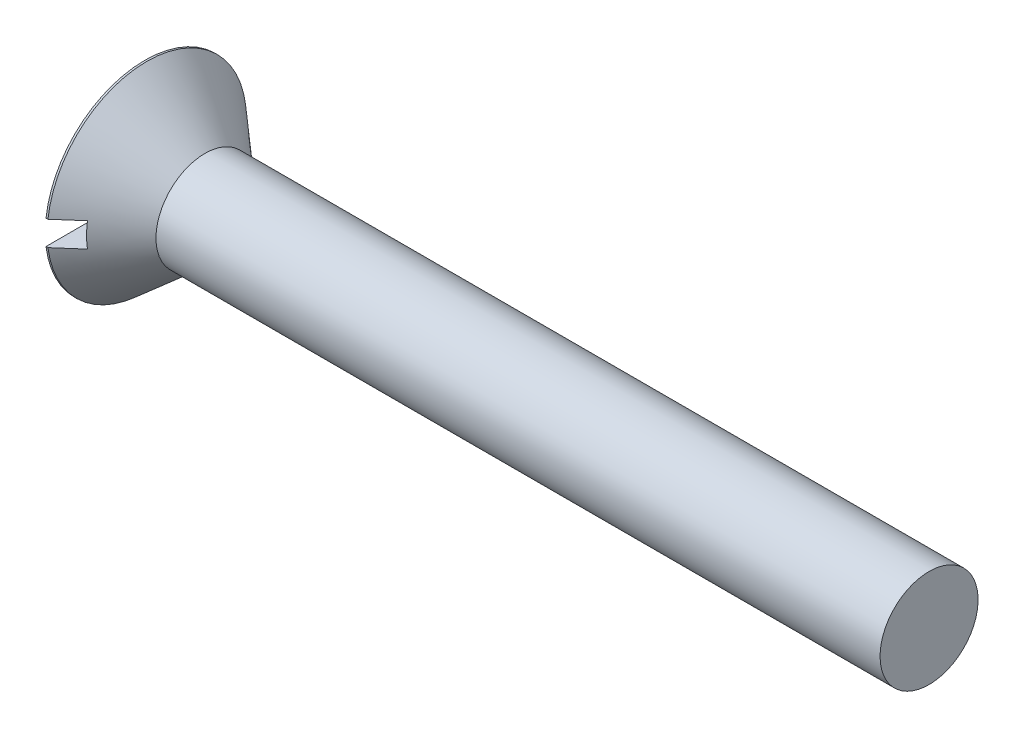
ISO-10303-21;
HEADER;
FILE_DESCRIPTION(('STEP AP214'),'2;1');
FILE_NAME('part.step','',(''),(''),'','','');
FILE_SCHEMA(('AUTOMOTIVE_DESIGN { 1 0 10303 214 1 1 1 1 }'));
ENDSEC;
DATA;
#1=APPLICATION_CONTEXT('core data for automotive mechanical design processes');
#2=APPLICATION_PROTOCOL_DEFINITION('international standard','automotive_design',2000,#1);
#3=PRODUCT_CONTEXT('',#1,'mechanical');
#4=PRODUCT('Part','Part','',(#3));
#5=PRODUCT_RELATED_PRODUCT_CATEGORY('part','',(#4));
#6=PRODUCT_DEFINITION_FORMATION('','',#4);
#7=PRODUCT_DEFINITION_CONTEXT('part definition',#1,'design');
#8=PRODUCT_DEFINITION('design','',#6,#7);
#9=PRODUCT_DEFINITION_SHAPE('','',#8);
#10=(LENGTH_UNIT() NAMED_UNIT(*) SI_UNIT(.MILLI.,.METRE.));
#11=(NAMED_UNIT(*) PLANE_ANGLE_UNIT() SI_UNIT($,.RADIAN.));
#12=(NAMED_UNIT(*) SI_UNIT($,.STERADIAN.) SOLID_ANGLE_UNIT());
#13=UNCERTAINTY_MEASURE_WITH_UNIT(LENGTH_MEASURE(1.E-05),#10,'distance_accuracy_value','');
#14=(GEOMETRIC_REPRESENTATION_CONTEXT(3) GLOBAL_UNCERTAINTY_ASSIGNED_CONTEXT((#13)) GLOBAL_UNIT_ASSIGNED_CONTEXT((#10,
#11,#12)) REPRESENTATION_CONTEXT('',''));
#15=CARTESIAN_POINT('',(0.,0.,0.));
#16=DIRECTION('',(0.,0.,1.));
#17=DIRECTION('',(1.,0.,0.));
#18=AXIS2_PLACEMENT_3D('',#15,#16,#17);
#19=CARTESIAN_POINT('',(0.,0.,0.));
#20=DIRECTION('',(-1.,0.,0.));
#21=DIRECTION('',(0.,0.,1.));
#22=AXIS2_PLACEMENT_3D('',#19,#20,#21);
#23=PLANE('',#22);
#24=DIRECTION('',(0.,0.,-1.));
#25=VECTOR('',#24,1.);
#26=CARTESIAN_POINT('',(0.,1.1938,9.6774));
#27=LINE('',#26,#25);
#28=CARTESIAN_POINT('',(0.,1.1938,9.60348438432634));
#29=VERTEX_POINT('',#28);
#30=CARTESIAN_POINT('',(0.,1.1938,-9.60348438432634));
#31=VERTEX_POINT('',#30);
#32=EDGE_CURVE('E152',#29,#31,#27,.T.);
#33=ORIENTED_EDGE('',*,*,#32,.F.);
#34=CARTESIAN_POINT('',(0.,0.,0.));
#35=DIRECTION('',(-1.,0.,0.));
#36=DIRECTION('',(0.,0.,1.));
#37=AXIS2_PLACEMENT_3D('',#34,#35,#36);
#38=CIRCLE('',#37,9.6774);
#39=EDGE_CURVE('E106',#29,#31,#38,.T.);
#40=ORIENTED_EDGE('',*,*,#39,.T.);
#41=EDGE_LOOP('',(#33,#40));
#42=FACE_BOUND('',#41,.T.);
#43=ADVANCED_FACE('F39',(#42),#23,.T.);
#44=CARTESIAN_POINT('',(-6.34999999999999,0.,0.));
#45=DIRECTION('',(-1.,0.,0.));
#46=DIRECTION('',(0.,0.,1.));
#47=AXIS2_PLACEMENT_3D('',#44,#45,#46);
#48=CYLINDRICAL_SURFACE('',#47,9.6774);
#49=DIRECTION('',(-1.,0.,0.));
#50=VECTOR('',#49,1.);
#51=CARTESIAN_POINT('',(-6.34999999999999,1.1938,-9.60348438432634));
#52=LINE('',#51,#50);
#53=CARTESIAN_POINT('',(0.188054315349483,1.1938,-9.60348438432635));
#54=VERTEX_POINT('',#53);
#55=EDGE_CURVE('E68',#31,#54,#52,.F.);
#56=ORIENTED_EDGE('',*,*,#55,.F.);
#57=ORIENTED_EDGE('',*,*,#39,.F.);
#58=DIRECTION('',(-1.,0.,0.));
#59=VECTOR('',#58,1.);
#60=CARTESIAN_POINT('',(-6.34999999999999,1.1938,9.60348438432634));
#61=LINE('',#60,#59);
#62=CARTESIAN_POINT('',(0.188054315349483,1.1938,9.60348438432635));
#63=VERTEX_POINT('',#62);
#64=EDGE_CURVE('E155',#63,#29,#61,.T.);
#65=ORIENTED_EDGE('',*,*,#64,.F.);
#66=CARTESIAN_POINT('',(0.188054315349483,0.,0.));
#67=DIRECTION('',(-1.,0.,0.));
#68=DIRECTION('',(0.,0.,1.));
#69=AXIS2_PLACEMENT_3D('',#66,#67,#68);
#70=CIRCLE('',#69,9.6774);
#71=EDGE_CURVE('E117',#63,#54,#70,.T.);
#72=ORIENTED_EDGE('',*,*,#71,.T.);
#73=EDGE_LOOP('',(#56,#57,#65,#72));
#74=FACE_BOUND('',#73,.T.);
#75=ADVANCED_FACE('F154',(#74),#48,.T.);
#76=DIRECTION('',(0.,0.,1.));
#77=VECTOR('',#76,1.);
#78=CARTESIAN_POINT('',(0.,-1.1938,-9.6774));
#79=LINE('',#78,#77);
#80=CARTESIAN_POINT('',(0.,-1.1938,-9.60348438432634));
#81=VERTEX_POINT('',#80);
#82=CARTESIAN_POINT('',(0.,-1.1938,9.60348438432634));
#83=VERTEX_POINT('',#82);
#84=EDGE_CURVE('E111',#81,#83,#79,.T.);
#85=ORIENTED_EDGE('',*,*,#84,.F.);
#86=EDGE_CURVE('E137',#81,#83,#38,.T.);
#87=ORIENTED_EDGE('',*,*,#86,.T.);
#88=EDGE_LOOP('',(#85,#87));
#89=FACE_BOUND('',#88,.T.);
#90=ADVANCED_FACE('F41',(#89),#23,.T.);
#91=DIRECTION('',(-1.,0.,0.));
#92=VECTOR('',#91,1.);
#93=CARTESIAN_POINT('',(-6.34999999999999,-1.1938,9.60348438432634));
#94=LINE('',#93,#92);
#95=CARTESIAN_POINT('',(0.188054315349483,-1.1938,9.60348438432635));
#96=VERTEX_POINT('',#95);
#97=EDGE_CURVE('E138',#83,#96,#94,.F.);
#98=ORIENTED_EDGE('',*,*,#97,.F.);
#99=ORIENTED_EDGE('',*,*,#86,.F.);
#100=DIRECTION('',(-1.,0.,0.));
#101=VECTOR('',#100,1.);
#102=CARTESIAN_POINT('',(-6.34999999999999,-1.1938,-9.60348438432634));
#103=LINE('',#102,#101);
#104=CARTESIAN_POINT('',(0.188054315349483,-1.1938,-9.60348438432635));
#105=VERTEX_POINT('',#104);
#106=EDGE_CURVE('E127',#105,#81,#103,.T.);
#107=ORIENTED_EDGE('',*,*,#106,.F.);
#108=EDGE_CURVE('E135',#105,#96,#70,.T.);
#109=ORIENTED_EDGE('',*,*,#108,.T.);
#110=EDGE_LOOP('',(#98,#99,#107,#109));
#111=FACE_BOUND('',#110,.T.);
#112=ADVANCED_FACE('F134',(#111),#48,.T.);
#113=CARTESIAN_POINT('',(0.188054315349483,0.,0.));
#114=DIRECTION('',(-1.,0.,0.));
#115=DIRECTION('',(0.,0.,1.));
#116=AXIS2_PLACEMENT_3D('',#113,#114,#115);
#117=CONICAL_SURFACE('',#116,9.6774,0.715584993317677);
#118=CARTESIAN_POINT('',(-11.4898026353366,1.1938,-19.7928369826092));
#119=CARTESIAN_POINT('',(-10.7282739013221,1.1938,-19.1296381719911));
#120=CARTESIAN_POINT('',(-9.96679664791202,1.1938,-18.4663802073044));
#121=CARTESIAN_POINT('',(-8.44400448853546,1.1938,-17.1396696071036));
#122=CARTESIAN_POINT('',(-7.68268958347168,1.1938,-16.4762169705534));
#123=CARTESIAN_POINT('',(-6.16009107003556,1.1938,-15.1488746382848));
#124=CARTESIAN_POINT('',(-5.39880752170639,1.1938,-14.4849848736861));
#125=CARTESIAN_POINT('',(-3.87658787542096,1.1938,-13.156815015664));
#126=CARTESIAN_POINT('',(-3.11565177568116,1.1938,-12.4925349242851));
#127=CARTESIAN_POINT('',(-1.61266837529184,1.1938,-11.1793728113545));
#128=CARTESIAN_POINT('',(-0.870608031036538,1.1938,-10.5305057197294));
#129=CARTESIAN_POINT('',(0.612654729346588,1.1938,-9.23176820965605));
#130=CARTESIAN_POINT('',(1.35385713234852,1.1938,-8.58189777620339));
#131=CARTESIAN_POINT('',(2.46431349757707,1.1938,-7.6057063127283));
#132=CARTESIAN_POINT('',(2.83420463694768,1.1938,-7.28011039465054));
#133=CARTESIAN_POINT('',(3.5733462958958,1.1938,-6.62818839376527));
#134=CARTESIAN_POINT('',(3.94259681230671,1.1938,-6.30186230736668));
#135=CARTESIAN_POINT('',(4.68009898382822,1.1938,-5.64810195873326));
#136=CARTESIAN_POINT('',(5.04835066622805,1.1938,-5.32066772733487));
#137=CARTESIAN_POINT('',(5.59944958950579,1.1938,-4.828088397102));
#138=CARTESIAN_POINT('',(5.78293538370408,1.1938,-4.66365796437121));
#139=CARTESIAN_POINT('',(6.14932062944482,1.1938,-4.33414540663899));
#140=CARTESIAN_POINT('',(6.33222008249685,1.1938,-4.16906328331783));
#141=CARTESIAN_POINT('',(6.61085838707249,1.1938,-3.91630624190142));
#142=CARTESIAN_POINT('',(6.7068950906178,1.1938,-3.82895981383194));
#143=CARTESIAN_POINT('',(6.89868546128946,1.1938,-3.65395652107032));
#144=CARTESIAN_POINT('',(6.99443912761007,1.1938,-3.56629965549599));
#145=CARTESIAN_POINT('',(7.28123634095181,1.1938,-3.30272759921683));
#146=CARTESIAN_POINT('',(7.47176893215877,1.1938,-3.12625362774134));
#147=CARTESIAN_POINT('',(7.75652836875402,1.1938,-2.85918720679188));
#148=CARTESIAN_POINT('',(7.85158225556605,1.1938,-2.76947695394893));
#149=CARTESIAN_POINT('',(8.04094270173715,1.1938,-2.58927165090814));
#150=CARTESIAN_POINT('',(8.13524926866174,1.1938,-2.49877660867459));
#151=CARTESIAN_POINT('',(8.32280199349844,1.1938,-2.31680042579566));
#152=CARTESIAN_POINT('',(8.41604873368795,1.1938,-2.22531988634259));
#153=CARTESIAN_POINT('',(8.6011346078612,1.1938,-2.04094854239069));
#154=CARTESIAN_POINT('',(8.6929738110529,1.1938,-1.94805780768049));
#155=CARTESIAN_POINT('',(8.87422797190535,1.1938,-1.76066399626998));
#156=CARTESIAN_POINT('',(8.96365125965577,1.1938,-1.66616899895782));
#157=CARTESIAN_POINT('',(9.13952454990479,1.1938,-1.47414431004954));
#158=CARTESIAN_POINT('',(9.22596985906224,1.1938,-1.37661025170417));
#159=CARTESIAN_POINT('',(9.35151816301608,1.1938,-1.22717825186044));
#160=CARTESIAN_POINT('',(9.39260236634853,1.1938,-1.17695004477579));
#161=CARTESIAN_POINT('',(9.47299969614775,1.1938,-1.07510106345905));
#162=CARTESIAN_POINT('',(9.5123131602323,1.1938,-1.02348055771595));
#163=CARTESIAN_POINT('',(9.58844644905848,1.1938,-0.918595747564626));
#164=CARTESIAN_POINT('',(9.62527166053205,1.1938,-0.865335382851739));
#165=CARTESIAN_POINT('',(9.69553557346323,1.1938,-0.756643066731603));
#166=CARTESIAN_POINT('',(9.72897683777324,1.1938,-0.701212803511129));
#167=CARTESIAN_POINT('',(9.78229490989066,1.1938,-0.603634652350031));
#168=CARTESIAN_POINT('',(9.80334267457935,1.1938,-0.562131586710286));
#169=CARTESIAN_POINT('',(9.84217202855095,1.1938,-0.47758953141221));
#170=CARTESIAN_POINT('',(9.85995294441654,1.1938,-0.434550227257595));
#171=CARTESIAN_POINT('',(9.89116809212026,1.1938,-0.347314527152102));
#172=CARTESIAN_POINT('',(9.90463847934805,1.1938,-0.303131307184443));
#173=CARTESIAN_POINT('',(9.92643385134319,1.1938,-0.213513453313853));
#174=CARTESIAN_POINT('',(9.93476333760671,1.1938,-0.16807995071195));
#175=CARTESIAN_POINT('',(9.94391422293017,1.1938,-0.0900477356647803));
#176=CARTESIAN_POINT('',(9.94622642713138,1.1938,-0.057620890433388));
#177=CARTESIAN_POINT('',(9.94780330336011,1.1938,0.00730866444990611));
#178=CARTESIAN_POINT('',(9.94706765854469,1.1938,0.039811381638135));
#179=CARTESIAN_POINT('',(9.94028733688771,1.1938,0.137101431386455));
#180=CARTESIAN_POINT('',(9.92966101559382,1.1938,0.20160008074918));
#181=CARTESIAN_POINT('',(9.89262661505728,1.1938,0.35049459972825));
#182=CARTESIAN_POINT('',(9.86193906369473,1.1938,0.433774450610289));
#183=CARTESIAN_POINT('',(9.80699388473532,1.1938,0.554532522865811));
#184=CARTESIAN_POINT('',(9.78712669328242,1.1938,0.594194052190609));
#185=CARTESIAN_POINT('',(9.74504611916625,1.1938,0.672252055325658));
#186=CARTESIAN_POINT('',(9.72283341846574,1.1938,0.710648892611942));
#187=CARTESIAN_POINT('',(9.65802013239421,1.1938,0.816731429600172));
#188=CARTESIAN_POINT('',(9.61337970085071,1.1938,0.883159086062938));
#189=CARTESIAN_POINT('',(9.52026331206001,1.1938,1.01329132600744));
#190=CARTESIAN_POINT('',(9.47178430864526,1.1938,1.07699368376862));
#191=CARTESIAN_POINT('',(9.37210823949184,1.1938,1.20247328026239));
#192=CARTESIAN_POINT('',(9.32090484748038,1.1938,1.2642454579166));
#193=CARTESIAN_POINT('',(9.21665334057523,1.1938,1.38621561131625));
#194=CARTESIAN_POINT('',(9.16360498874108,1.1938,1.44641338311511));
#195=CARTESIAN_POINT('',(9.0558712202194,1.1938,1.56591847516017));
#196=CARTESIAN_POINT('',(9.00117844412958,1.1938,1.62521913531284));
#197=CARTESIAN_POINT('',(8.89076932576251,1.1938,1.74286468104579));
#198=CARTESIAN_POINT('',(8.83505291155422,1.1938,1.80120949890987));
#199=CARTESIAN_POINT('',(8.72293087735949,1.1938,1.91703874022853));
#200=CARTESIAN_POINT('',(8.66652659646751,1.1938,1.97452446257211));
#201=CARTESIAN_POINT('',(8.55310321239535,1.1938,2.08888148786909));
#202=CARTESIAN_POINT('',(8.49608412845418,1.1938,2.14575280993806));
#203=CARTESIAN_POINT('',(8.32594080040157,1.1938,2.31399298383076));
#204=CARTESIAN_POINT('',(8.21210974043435,1.1938,2.4246466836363));
#205=CARTESIAN_POINT('',(7.98316902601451,1.1938,2.64462506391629));
#206=CARTESIAN_POINT('',(7.86805933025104,1.1938,2.75394970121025));
#207=CARTESIAN_POINT('',(7.63692082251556,1.1938,2.97164536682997));
#208=CARTESIAN_POINT('',(7.52089191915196,1.1938,3.08001629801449));
#209=CARTESIAN_POINT('',(7.2881654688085,1.1938,3.29603831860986));
#210=CARTESIAN_POINT('',(7.17146791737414,1.1938,3.40368940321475));
#211=CARTESIAN_POINT('',(6.8204206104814,1.1938,3.72601676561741));
#212=CARTESIAN_POINT('',(6.58532082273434,1.1938,3.93987573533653));
#213=CARTESIAN_POINT('',(6.11392315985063,1.1938,4.36623728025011));
#214=CARTESIAN_POINT('',(5.87762535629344,1.1938,4.57873993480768));
#215=CARTESIAN_POINT('',(5.40574548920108,1.1938,5.00148246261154));
#216=CARTESIAN_POINT('',(5.17016858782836,1.1938,5.21172810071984));
#217=CARTESIAN_POINT('',(4.69845742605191,1.1938,5.63159996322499));
#218=CARTESIAN_POINT('',(4.46232315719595,1.1938,5.8412261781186));
#219=CARTESIAN_POINT('',(3.75350149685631,1.1938,6.46928311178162));
#220=CARTESIAN_POINT('',(3.28022270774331,1.1938,6.88704616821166));
#221=CARTESIAN_POINT('',(2.21621828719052,1.1938,7.82423394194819));
#222=CARTESIAN_POINT('',(1.62524790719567,1.1938,8.34338046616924));
#223=CARTESIAN_POINT('',(0.442525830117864,1.1938,9.38078521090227));
#224=CARTESIAN_POINT('',(-0.149225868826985,1.1938,9.89904342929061));
#225=CARTESIAN_POINT('',(-1.33330631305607,1.1938,10.9350846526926));
#226=CARTESIAN_POINT('',(-1.92563513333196,1.1938,11.4528675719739));
#227=CARTESIAN_POINT('',(-3.11061605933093,1.1938,12.4880633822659));
#228=CARTESIAN_POINT('',(-3.70326816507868,1.1938,13.0054762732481));
#229=CARTESIAN_POINT('',(-5.49445193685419,1.1938,14.5685909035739));
#230=CARTESIAN_POINT('',(-6.69332378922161,1.1938,15.6139027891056));
#231=CARTESIAN_POINT('',(-8.49189186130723,1.1938,17.1813761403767));
#232=CARTESIAN_POINT('',(-9.09140946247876,1.1938,17.7037426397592));
#233=CARTESIAN_POINT('',(-10.2905401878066,1.1938,18.7483656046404));
#234=CARTESIAN_POINT('',(-10.8901533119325,1.1938,19.2706220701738));
#235=CARTESIAN_POINT('',(-11.4898026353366,1.1938,19.7928369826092));
#236=B_SPLINE_CURVE_WITH_KNOTS('',3,(#118,#119,#120,#121,#122,#123,#124,#125,#126,#127,#128,
#129,#130,#131,#132,#133,#134,#135,#136,#137,#138,#139,#140,#141,#142,#143,#144,#145,#146,#147,
#148,#149,#150,#151,#152,#153,#154,#155,#156,#157,#158,#159,#160,#161,#162,#163,#164,#165,#166,
#167,#168,#169,#170,#171,#172,#173,#174,#175,#176,#177,#178,#179,#180,#181,#182,#183,#184,#185,
#186,#187,#188,#189,#190,#191,#192,#193,#194,#195,#196,#197,#198,#199,#200,#201,#202,#203,#204,
#205,#206,#207,#208,#209,#210,#211,#212,#213,#214,#215,#216,#217,#218,#219,#220,#221,#222,#223,
#224,#225,#226,#227,#228,#229,#230,#231,#232,#233,#234,#235),.UNSPECIFIED.,.F.,.F.,(4,2,2,2,2,2,
2,2,2,2,2,2,2,2,2,2,2,2,2,2,2,2,2,2,2,2,2,2,2,2,2,2,2,2,2,2,2,2,2,2,2,2,2,2,2,2,2,2,2,2,2,2,2,2,
2,2,2,2,4),(0.,3.0294930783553,6.05900258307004,9.08930288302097,12.1195874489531,
15.0768051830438,18.0340675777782,19.512406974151,20.9907536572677,22.4690595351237,
23.2082064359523,23.9473514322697,24.3368016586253,24.7262529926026,25.5053464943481,
25.8974512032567,26.2895519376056,26.6814256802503,27.0732800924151,27.4635432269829,
27.8543956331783,28.0490394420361,28.2436459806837,28.4378167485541,28.6318393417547,
28.7713378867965,28.9108651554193,29.049189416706,29.1873923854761,29.2847831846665,
29.3821841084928,29.5771956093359,29.8418190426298,29.9748586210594,30.1078596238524,
30.3477358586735,30.5878043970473,30.8284570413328,31.0691407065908,31.3111390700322,
31.5531545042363,31.7947567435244,32.0363514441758,32.5125848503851,32.9888336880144,
33.4651304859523,33.9414304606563,34.894870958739,35.8482551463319,36.7955112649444,
37.7427818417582,39.6366290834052,41.9964650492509,44.3563066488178,46.7165126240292,
49.0767187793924,53.8484828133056,56.2339792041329,58.619474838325),.UNSPECIFIED.);
#237=CARTESIAN_POINT('',(2.2352,1.1938,-7.80709754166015));
#238=VERTEX_POINT('',#237);
#239=EDGE_CURVE('E11',#54,#238,#236,.T.);
#240=ORIENTED_EDGE('',*,*,#239,.F.);
#241=ORIENTED_EDGE('',*,*,#71,.F.);
#242=CARTESIAN_POINT('',(2.2352,1.1938,7.80709754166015));
#243=VERTEX_POINT('',#242);
#244=EDGE_CURVE('E43',#243,#63,#236,.T.);
#245=ORIENTED_EDGE('',*,*,#244,.F.);
#246=CARTESIAN_POINT('',(2.2352,0.,0.));
#247=DIRECTION('',(-1.,0.,0.));
#248=DIRECTION('',(0.,0.,1.));
#249=AXIS2_PLACEMENT_3D('',#246,#247,#248);
#250=CIRCLE('',#249,7.89784340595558);
#251=CARTESIAN_POINT('',(2.2352,-1.1938,7.80709754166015));
#252=VERTEX_POINT('',#251);
#253=EDGE_CURVE('E97',#243,#252,#250,.F.);
#254=ORIENTED_EDGE('',*,*,#253,.T.);
#255=CARTESIAN_POINT('',(-11.4898026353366,-1.1938,19.7928369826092));
#256=CARTESIAN_POINT('',(-10.7282739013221,-1.1938,19.1296381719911));
#257=CARTESIAN_POINT('',(-9.96679664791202,-1.1938,18.4663802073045));
#258=CARTESIAN_POINT('',(-8.44400448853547,-1.1938,17.1396696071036));
#259=CARTESIAN_POINT('',(-7.68268958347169,-1.1938,16.4762169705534));
#260=CARTESIAN_POINT('',(-6.16009107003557,-1.1938,15.1488746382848));
#261=CARTESIAN_POINT('',(-5.39880752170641,-1.1938,14.4849848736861));
#262=CARTESIAN_POINT('',(-3.87658787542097,-1.1938,13.156815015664));
#263=CARTESIAN_POINT('',(-3.11565177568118,-1.1938,12.4925349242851));
#264=CARTESIAN_POINT('',(-1.61266837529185,-1.1938,11.1793728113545));
#265=CARTESIAN_POINT('',(-0.870608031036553,-1.1938,10.5305057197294));
#266=CARTESIAN_POINT('',(0.612654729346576,-1.1938,9.23176820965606));
#267=CARTESIAN_POINT('',(1.35385713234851,-1.1938,8.5818977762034));
#268=CARTESIAN_POINT('',(2.46431349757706,-1.1938,7.60570631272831));
#269=CARTESIAN_POINT('',(2.83420463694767,-1.1938,7.28011039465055));
#270=CARTESIAN_POINT('',(3.5733462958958,-1.1938,6.62818839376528));
#271=CARTESIAN_POINT('',(3.9425968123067,-1.1938,6.30186230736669));
#272=CARTESIAN_POINT('',(4.68009898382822,-1.1938,5.64810195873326));
#273=CARTESIAN_POINT('',(5.04835066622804,-1.1938,5.32066772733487));
#274=CARTESIAN_POINT('',(5.59944958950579,-1.1938,4.828088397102));
#275=CARTESIAN_POINT('',(5.78293538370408,-1.1938,4.66365796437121));
#276=CARTESIAN_POINT('',(6.14932062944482,-1.1938,4.33414540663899));
#277=CARTESIAN_POINT('',(6.33222008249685,-1.1938,4.16906328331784));
#278=CARTESIAN_POINT('',(6.61085838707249,-1.1938,3.91630624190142));
#279=CARTESIAN_POINT('',(6.7068950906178,-1.1938,3.82895981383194));
#280=CARTESIAN_POINT('',(6.89868546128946,-1.1938,3.65395652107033));
#281=CARTESIAN_POINT('',(6.99443912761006,-1.1938,3.56629965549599));
#282=CARTESIAN_POINT('',(7.28123634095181,-1.1938,3.30272759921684));
#283=CARTESIAN_POINT('',(7.47176893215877,-1.1938,3.12625362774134));
#284=CARTESIAN_POINT('',(7.75652836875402,-1.1938,2.85918720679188));
#285=CARTESIAN_POINT('',(7.85158225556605,-1.1938,2.76947695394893));
#286=CARTESIAN_POINT('',(8.04094270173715,-1.1938,2.58927165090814));
#287=CARTESIAN_POINT('',(8.13524926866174,-1.1938,2.49877660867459));
#288=CARTESIAN_POINT('',(8.32280199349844,-1.1938,2.31680042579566));
#289=CARTESIAN_POINT('',(8.41604873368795,-1.1938,2.22531988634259));
#290=CARTESIAN_POINT('',(8.6011346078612,-1.1938,2.04094854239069));
#291=CARTESIAN_POINT('',(8.6929738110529,-1.1938,1.94805780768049));
#292=CARTESIAN_POINT('',(8.87422797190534,-1.1938,1.76066399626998));
#293=CARTESIAN_POINT('',(8.96365125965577,-1.1938,1.66616899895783));
#294=CARTESIAN_POINT('',(9.13952454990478,-1.1938,1.47414431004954));
#295=CARTESIAN_POINT('',(9.22596985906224,-1.1938,1.37661025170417));
#296=CARTESIAN_POINT('',(9.35151816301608,-1.1938,1.22717825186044));
#297=CARTESIAN_POINT('',(9.39260236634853,-1.1938,1.17695004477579));
#298=CARTESIAN_POINT('',(9.47299969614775,-1.1938,1.07510106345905));
#299=CARTESIAN_POINT('',(9.5123131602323,-1.1938,1.02348055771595));
#300=CARTESIAN_POINT('',(9.58844644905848,-1.1938,0.918595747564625));
#301=CARTESIAN_POINT('',(9.62527166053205,-1.1938,0.865335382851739));
#302=CARTESIAN_POINT('',(9.69553557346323,-1.1938,0.756643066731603));
#303=CARTESIAN_POINT('',(9.72897683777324,-1.1938,0.701212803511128));
#304=CARTESIAN_POINT('',(9.78229490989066,-1.1938,0.603634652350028));
#305=CARTESIAN_POINT('',(9.80334267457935,-1.1938,0.562131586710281));
#306=CARTESIAN_POINT('',(9.84217202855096,-1.1938,0.477589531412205));
#307=CARTESIAN_POINT('',(9.85995294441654,-1.1938,0.434550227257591));
#308=CARTESIAN_POINT('',(9.89116809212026,-1.1938,0.347314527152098));
#309=CARTESIAN_POINT('',(9.90463847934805,-1.1938,0.303131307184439));
#310=CARTESIAN_POINT('',(9.92643385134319,-1.1938,0.21351345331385));
#311=CARTESIAN_POINT('',(9.93476333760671,-1.1938,0.168079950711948));
#312=CARTESIAN_POINT('',(9.94391422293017,-1.1938,0.0900477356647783));
#313=CARTESIAN_POINT('',(9.94622642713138,-1.1938,0.0576208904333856));
#314=CARTESIAN_POINT('',(9.94780330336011,-1.1938,-0.0073086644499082));
#315=CARTESIAN_POINT('',(9.94706765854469,-1.1938,-0.0398113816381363));
#316=CARTESIAN_POINT('',(9.94028733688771,-1.1938,-0.137101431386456));
#317=CARTESIAN_POINT('',(9.92966101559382,-1.1938,-0.201600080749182));
#318=CARTESIAN_POINT('',(9.89262661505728,-1.1938,-0.350494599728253));
#319=CARTESIAN_POINT('',(9.86193906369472,-1.1938,-0.433774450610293));
#320=CARTESIAN_POINT('',(9.80699388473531,-1.1938,-0.554532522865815));
#321=CARTESIAN_POINT('',(9.78712669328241,-1.1938,-0.594194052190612));
#322=CARTESIAN_POINT('',(9.74504611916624,-1.1938,-0.672252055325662));
#323=CARTESIAN_POINT('',(9.72283341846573,-1.1938,-0.710648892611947));
#324=CARTESIAN_POINT('',(9.65802013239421,-1.1938,-0.816731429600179));
#325=CARTESIAN_POINT('',(9.61337970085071,-1.1938,-0.883159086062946));
#326=CARTESIAN_POINT('',(9.52026331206,-1.1938,-1.01329132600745));
#327=CARTESIAN_POINT('',(9.47178430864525,-1.1938,-1.07699368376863));
#328=CARTESIAN_POINT('',(9.37210823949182,-1.1938,-1.2024732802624));
#329=CARTESIAN_POINT('',(9.32090484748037,-1.1938,-1.26424545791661));
#330=CARTESIAN_POINT('',(9.21665334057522,-1.1938,-1.38621561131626));
#331=CARTESIAN_POINT('',(9.16360498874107,-1.1938,-1.44641338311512));
#332=CARTESIAN_POINT('',(9.05587122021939,-1.1938,-1.56591847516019));
#333=CARTESIAN_POINT('',(9.00117844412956,-1.1938,-1.62521913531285));
#334=CARTESIAN_POINT('',(8.8907693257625,-1.1938,-1.7428646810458));
#335=CARTESIAN_POINT('',(8.83505291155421,-1.1938,-1.80120949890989));
#336=CARTESIAN_POINT('',(8.72293087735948,-1.1938,-1.91703874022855));
#337=CARTESIAN_POINT('',(8.6665265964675,-1.1938,-1.97452446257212));
#338=CARTESIAN_POINT('',(8.55310321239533,-1.1938,-2.08888148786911));
#339=CARTESIAN_POINT('',(8.49608412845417,-1.1938,-2.14575280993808));
#340=CARTESIAN_POINT('',(8.32594080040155,-1.1938,-2.31399298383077));
#341=CARTESIAN_POINT('',(8.21210974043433,-1.1938,-2.42464668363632));
#342=CARTESIAN_POINT('',(7.98316902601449,-1.1938,-2.64462506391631));
#343=CARTESIAN_POINT('',(7.86805933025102,-1.1938,-2.75394970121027));
#344=CARTESIAN_POINT('',(7.63692082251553,-1.1938,-2.97164536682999));
#345=CARTESIAN_POINT('',(7.52089191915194,-1.1938,-3.08001629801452));
#346=CARTESIAN_POINT('',(7.28816546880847,-1.1938,-3.29603831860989));
#347=CARTESIAN_POINT('',(7.17146791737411,-1.1938,-3.40368940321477));
#348=CARTESIAN_POINT('',(6.82042061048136,-1.1938,-3.72601676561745));
#349=CARTESIAN_POINT('',(6.5853208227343,-1.1938,-3.93987573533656));
#350=CARTESIAN_POINT('',(6.11392315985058,-1.1938,-4.36623728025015));
#351=CARTESIAN_POINT('',(5.87762535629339,-1.1938,-4.57873993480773));
#352=CARTESIAN_POINT('',(5.40574548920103,-1.1938,-5.00148246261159));
#353=CARTESIAN_POINT('',(5.17016858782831,-1.1938,-5.21172810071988));
#354=CARTESIAN_POINT('',(4.69845742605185,-1.1938,-5.63159996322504));
#355=CARTESIAN_POINT('',(4.46232315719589,-1.1938,-5.84122617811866));
#356=CARTESIAN_POINT('',(3.75350149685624,-1.1938,-6.46928311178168));
#357=CARTESIAN_POINT('',(3.28022270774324,-1.1938,-6.88704616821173));
#358=CARTESIAN_POINT('',(2.21621828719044,-1.1938,-7.82423394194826));
#359=CARTESIAN_POINT('',(1.62524790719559,-1.1938,-8.34338046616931));
#360=CARTESIAN_POINT('',(0.442525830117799,-1.1938,-9.38078521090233));
#361=CARTESIAN_POINT('',(-0.149225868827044,-1.1938,-9.89904342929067));
#362=CARTESIAN_POINT('',(-1.33330631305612,-1.1938,-10.9350846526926));
#363=CARTESIAN_POINT('',(-1.92563513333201,-1.1938,-11.452867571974));
#364=CARTESIAN_POINT('',(-3.11061605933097,-1.1938,-12.4880633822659));
#365=CARTESIAN_POINT('',(-3.70326816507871,-1.1938,-13.0054762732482));
#366=CARTESIAN_POINT('',(-5.49445193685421,-1.1938,-14.5685909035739));
#367=CARTESIAN_POINT('',(-6.69332378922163,-1.1938,-15.6139027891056));
#368=CARTESIAN_POINT('',(-8.49189186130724,-1.1938,-17.1813761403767));
#369=CARTESIAN_POINT('',(-9.09140946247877,-1.1938,-17.7037426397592));
#370=CARTESIAN_POINT('',(-10.2905401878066,-1.1938,-18.7483656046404));
#371=CARTESIAN_POINT('',(-10.8901533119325,-1.1938,-19.2706220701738));
#372=CARTESIAN_POINT('',(-11.4898026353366,-1.1938,-19.7928369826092));
#373=B_SPLINE_CURVE_WITH_KNOTS('',3,(#255,#256,#257,#258,#259,#260,#261,#262,#263,#264,#265,
#266,#267,#268,#269,#270,#271,#272,#273,#274,#275,#276,#277,#278,#279,#280,#281,#282,#283,#284,
#285,#286,#287,#288,#289,#290,#291,#292,#293,#294,#295,#296,#297,#298,#299,#300,#301,#302,#303,
#304,#305,#306,#307,#308,#309,#310,#311,#312,#313,#314,#315,#316,#317,#318,#319,#320,#321,#322,
#323,#324,#325,#326,#327,#328,#329,#330,#331,#332,#333,#334,#335,#336,#337,#338,#339,#340,#341,
#342,#343,#344,#345,#346,#347,#348,#349,#350,#351,#352,#353,#354,#355,#356,#357,#358,#359,#360,
#361,#362,#363,#364,#365,#366,#367,#368,#369,#370,#371,#372),.UNSPECIFIED.,.F.,.F.,(4,2,2,2,2,2,
2,2,2,2,2,2,2,2,2,2,2,2,2,2,2,2,2,2,2,2,2,2,2,2,2,2,2,2,2,2,2,2,2,2,2,2,2,2,2,2,2,2,2,2,2,2,2,2,
2,2,2,2,4),(0.,3.02949307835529,6.05900258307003,9.08930288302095,12.1195874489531,
15.0768051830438,18.0340675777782,19.512406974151,20.9907536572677,22.4690595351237,
23.2082064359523,23.9473514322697,24.3368016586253,24.7262529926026,25.5053464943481,
25.8974512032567,26.2895519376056,26.6814256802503,27.0732800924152,27.4635432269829,
27.8543956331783,28.0490394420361,28.2436459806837,28.4378167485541,28.6318393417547,
28.7713378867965,28.9108651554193,29.049189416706,29.1873923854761,29.2847831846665,
29.3821841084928,29.5771956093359,29.8418190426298,29.9748586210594,30.1078596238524,
30.3477358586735,30.5878043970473,30.8284570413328,31.0691407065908,31.3111390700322,
31.5531545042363,31.7947567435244,32.0363514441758,32.5125848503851,32.9888336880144,
33.4651304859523,33.9414304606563,34.8948709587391,35.848255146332,36.7955112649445,
37.7427818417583,39.6366290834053,41.996465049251,44.3563066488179,46.7165126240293,
49.0767187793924,53.8484828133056,56.2339792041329,58.619474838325),.UNSPECIFIED.);
#374=EDGE_CURVE('E105',#96,#252,#373,.T.);
#375=ORIENTED_EDGE('',*,*,#374,.F.);
#376=ORIENTED_EDGE('',*,*,#108,.F.);
#377=CARTESIAN_POINT('',(2.2352,-1.1938,-7.80709754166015));
#378=VERTEX_POINT('',#377);
#379=EDGE_CURVE('E54',#378,#105,#373,.T.);
#380=ORIENTED_EDGE('',*,*,#379,.F.);
#381=EDGE_CURVE('E108',#378,#238,#250,.F.);
#382=ORIENTED_EDGE('',*,*,#381,.T.);
#383=EDGE_LOOP('',(#240,#241,#245,#254,#375,#376,#380,#382));
#384=FACE_BOUND('',#383,.T.);
#385=CARTESIAN_POINT('',(5.842,0.,0.));
#386=DIRECTION('',(-1.,0.,0.));
#387=DIRECTION('',(0.,0.,1.));
#388=AXIS2_PLACEMENT_3D('',#385,#386,#387);
#389=CIRCLE('',#388,4.7625);
#390=CARTESIAN_POINT('',(5.842,0.,4.7625));
#391=VERTEX_POINT('',#390);
#392=EDGE_CURVE('E140',#391,#391,#389,.T.);
#393=ORIENTED_EDGE('',*,*,#392,.T.);
#394=EDGE_LOOP('',(#393));
#395=FACE_BOUND('',#394,.T.);
#396=ADVANCED_FACE('F114',(#384,#395),#117,.T.);
#397=CARTESIAN_POINT('',(-6.34999999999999,0.,0.));
#398=DIRECTION('',(-1.,0.,0.));
#399=DIRECTION('',(0.,0.,1.));
#400=AXIS2_PLACEMENT_3D('',#397,#398,#399);
#401=CYLINDRICAL_SURFACE('',#400,4.7625);
#402=CARTESIAN_POINT('',(76.2,0.,0.));
#403=DIRECTION('',(-1.,0.,0.));
#404=DIRECTION('',(0.,0.,1.));
#405=AXIS2_PLACEMENT_3D('',#402,#403,#404);
#406=CIRCLE('',#405,4.7625);
#407=CARTESIAN_POINT('',(76.2,0.,4.7625));
#408=VERTEX_POINT('',#407);
#409=EDGE_CURVE('E143',#408,#408,#406,.T.);
#410=ORIENTED_EDGE('',*,*,#409,.T.);
#411=EDGE_LOOP('',(#410));
#412=FACE_BOUND('',#411,.T.);
#413=ORIENTED_EDGE('',*,*,#392,.F.);
#414=EDGE_LOOP('',(#413));
#415=FACE_BOUND('',#414,.T.);
#416=ADVANCED_FACE('F217',(#412,#415),#401,.T.);
#417=CARTESIAN_POINT('',(76.2,4.7625,0.));
#418=DIRECTION('',(1.,0.,0.));
#419=DIRECTION('',(0.,0.,-1.));
#420=AXIS2_PLACEMENT_3D('',#417,#418,#419);
#421=PLANE('',#420);
#422=ORIENTED_EDGE('',*,*,#409,.F.);
#423=EDGE_LOOP('',(#422));
#424=FACE_BOUND('',#423,.T.);
#425=ADVANCED_FACE('F176',(#424),#421,.T.);
#426=CARTESIAN_POINT('',(2.2352,1.1938,9.6774));
#427=DIRECTION('',(0.,1.,0.));
#428=DIRECTION('',(0.,0.,1.));
#429=AXIS2_PLACEMENT_3D('',#426,#427,#428);
#430=PLANE('',#429);
#431=ORIENTED_EDGE('',*,*,#55,.T.);
#432=ORIENTED_EDGE('',*,*,#239,.T.);
#433=DIRECTION('',(0.,0.,-1.));
#434=VECTOR('',#433,1.);
#435=CARTESIAN_POINT('',(2.2352,1.1938,9.6774));
#436=LINE('',#435,#434);
#437=EDGE_CURVE('E100',#243,#238,#436,.T.);
#438=ORIENTED_EDGE('',*,*,#437,.F.);
#439=ORIENTED_EDGE('',*,*,#244,.T.);
#440=ORIENTED_EDGE('',*,*,#64,.T.);
#441=ORIENTED_EDGE('',*,*,#32,.T.);
#442=EDGE_LOOP('',(#431,#432,#438,#439,#440,#441));
#443=FACE_BOUND('',#442,.T.);
#444=ADVANCED_FACE('F109',(#443),#430,.F.);
#445=CARTESIAN_POINT('',(2.2352,-1.1938,-9.6774));
#446=DIRECTION('',(0.,-1.,0.));
#447=DIRECTION('',(0.,0.,-1.));
#448=AXIS2_PLACEMENT_3D('',#445,#446,#447);
#449=PLANE('',#448);
#450=ORIENTED_EDGE('',*,*,#97,.T.);
#451=ORIENTED_EDGE('',*,*,#374,.T.);
#452=DIRECTION('',(0.,0.,1.));
#453=VECTOR('',#452,1.);
#454=CARTESIAN_POINT('',(2.2352,-1.1938,-9.6774));
#455=LINE('',#454,#453);
#456=EDGE_CURVE('E61',#378,#252,#455,.T.);
#457=ORIENTED_EDGE('',*,*,#456,.F.);
#458=ORIENTED_EDGE('',*,*,#379,.T.);
#459=ORIENTED_EDGE('',*,*,#106,.T.);
#460=ORIENTED_EDGE('',*,*,#84,.T.);
#461=EDGE_LOOP('',(#450,#451,#457,#458,#459,#460));
#462=FACE_BOUND('',#461,.T.);
#463=ADVANCED_FACE('F126',(#462),#449,.F.);
#464=CARTESIAN_POINT('',(2.2352,1.1938,-9.67739999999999));
#465=DIRECTION('',(-1.,0.,0.));
#466=DIRECTION('',(0.,0.,1.));
#467=AXIS2_PLACEMENT_3D('',#464,#465,#466);
#468=PLANE('',#467);
#469=ORIENTED_EDGE('',*,*,#456,.T.);
#470=ORIENTED_EDGE('',*,*,#253,.F.);
#471=ORIENTED_EDGE('',*,*,#437,.T.);
#472=ORIENTED_EDGE('',*,*,#381,.F.);
#473=EDGE_LOOP('',(#469,#470,#471,#472));
#474=FACE_BOUND('',#473,.T.);
#475=ADVANCED_FACE('F99',(#474),#468,.T.);
#476=CLOSED_SHELL('',(#43,#75,#90,#112,#396,#416,#425,#444,#463,#475));
#477=MANIFOLD_SOLID_BREP('B2',#476);
#478=ADVANCED_BREP_SHAPE_REPRESENTATION('',(#18,#477),#14);
#479=SHAPE_DEFINITION_REPRESENTATION(#9,#478);
ENDSEC;
END-ISO-10303-21;
